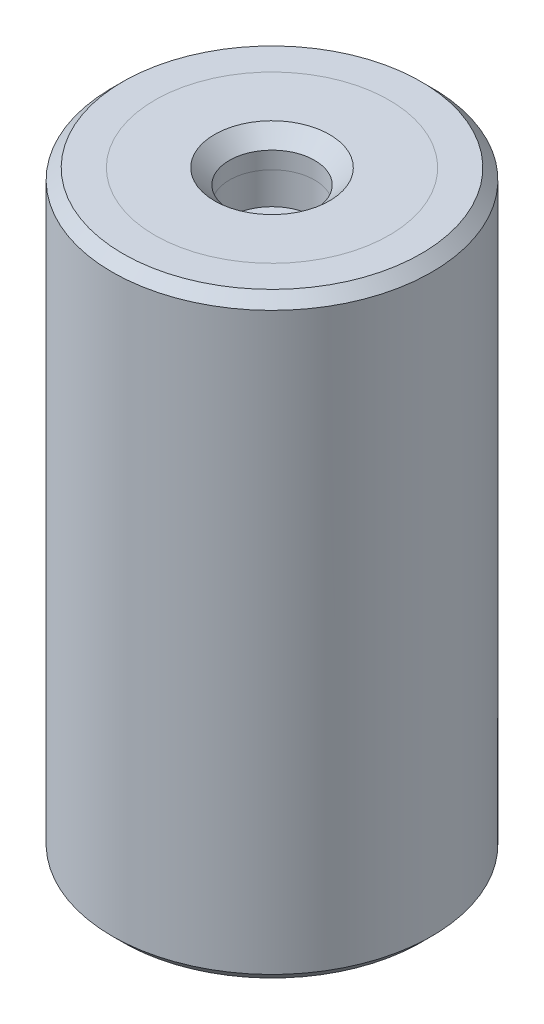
ISO-10303-21;
HEADER;
FILE_DESCRIPTION(('STEP AP214'),'2;1');
FILE_NAME('part.step','',(''),(''),'','','');
FILE_SCHEMA(('AUTOMOTIVE_DESIGN { 1 0 10303 214 1 1 1 1 }'));
ENDSEC;
DATA;
#1=APPLICATION_CONTEXT('core data for automotive mechanical design processes');
#2=APPLICATION_PROTOCOL_DEFINITION('international standard','automotive_design',2000,#1);
#3=PRODUCT_CONTEXT('',#1,'mechanical');
#4=PRODUCT('Part','Part','',(#3));
#5=PRODUCT_RELATED_PRODUCT_CATEGORY('part','',(#4));
#6=PRODUCT_DEFINITION_FORMATION('','',#4);
#7=PRODUCT_DEFINITION_CONTEXT('part definition',#1,'design');
#8=PRODUCT_DEFINITION('design','',#6,#7);
#9=PRODUCT_DEFINITION_SHAPE('','',#8);
#10=(LENGTH_UNIT() NAMED_UNIT(*) SI_UNIT(.MILLI.,.METRE.));
#11=(NAMED_UNIT(*) PLANE_ANGLE_UNIT() SI_UNIT($,.RADIAN.));
#12=(NAMED_UNIT(*) SI_UNIT($,.STERADIAN.) SOLID_ANGLE_UNIT());
#13=UNCERTAINTY_MEASURE_WITH_UNIT(LENGTH_MEASURE(1.E-05),#10,'distance_accuracy_value','');
#14=(GEOMETRIC_REPRESENTATION_CONTEXT(3) GLOBAL_UNCERTAINTY_ASSIGNED_CONTEXT((#13)) GLOBAL_UNIT_ASSIGNED_CONTEXT((#10,
#11,#12)) REPRESENTATION_CONTEXT('',''));
#15=CARTESIAN_POINT('',(0.,0.,0.));
#16=DIRECTION('',(0.,0.,1.));
#17=DIRECTION('',(1.,0.,0.));
#18=AXIS2_PLACEMENT_3D('',#15,#16,#17);
#19=CARTESIAN_POINT('',(0.,43.0340428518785,0.));
#20=DIRECTION('',(0.,1.,0.));
#21=DIRECTION('',(0.,0.,1.));
#22=AXIS2_PLACEMENT_3D('',#19,#20,#21);
#23=CYLINDRICAL_SURFACE('',#22,2.);
#24=CARTESIAN_POINT('',(0.,-25.8,0.));
#25=DIRECTION('',(0.,-1.,0.));
#26=DIRECTION('',(0.,0.,-1.));
#27=AXIS2_PLACEMENT_3D('',#24,#25,#26);
#28=CIRCLE('',#27,2.);
#29=CARTESIAN_POINT('',(0.,-25.8,-2.));
#30=VERTEX_POINT('',#29);
#31=EDGE_CURVE('P0_E10',#30,#30,#28,.T.);
#32=ORIENTED_EDGE('',*,*,#31,.T.);
#33=EDGE_LOOP('',(#32));
#34=FACE_BOUND('',#33,.T.);
#35=CARTESIAN_POINT('',(0.,-25.,0.));
#36=DIRECTION('',(0.,1.,0.));
#37=DIRECTION('',(0.,0.,1.));
#38=AXIS2_PLACEMENT_3D('',#35,#36,#37);
#39=CIRCLE('',#38,2.);
#40=CARTESIAN_POINT('',(0.,-25.,2.));
#41=VERTEX_POINT('',#40);
#42=EDGE_CURVE('P0_E25',#41,#41,#39,.T.);
#43=ORIENTED_EDGE('',*,*,#42,.T.);
#44=EDGE_LOOP('',(#43));
#45=FACE_BOUND('',#44,.T.);
#46=ADVANCED_FACE('P0_F14',(#34,#45),#23,.F.);
#47=CARTESIAN_POINT('',(0.,-25.,2.));
#48=DIRECTION('',(0.,1.,0.));
#49=DIRECTION('',(0.,0.,1.));
#50=AXIS2_PLACEMENT_3D('',#47,#48,#49);
#51=PLANE('',#50);
#52=CARTESIAN_POINT('',(0.,-25.,0.));
#53=DIRECTION('',(0.,1.,0.));
#54=DIRECTION('',(0.,0.,1.));
#55=AXIS2_PLACEMENT_3D('',#52,#53,#54);
#56=CIRCLE('',#55,5.5);
#57=CARTESIAN_POINT('',(0.,-25.,5.5));
#58=VERTEX_POINT('',#57);
#59=EDGE_CURVE('P0_E29',#58,#58,#56,.T.);
#60=ORIENTED_EDGE('',*,*,#59,.T.);
#61=EDGE_LOOP('',(#60));
#62=FACE_BOUND('',#61,.T.);
#63=ORIENTED_EDGE('',*,*,#42,.F.);
#64=EDGE_LOOP('',(#63));
#65=FACE_BOUND('',#64,.T.);
#66=ADVANCED_FACE('P0_F50',(#62,#65),#51,.T.);
#67=CARTESIAN_POINT('',(0.,43.0340428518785,0.));
#68=DIRECTION('',(0.,1.,0.));
#69=DIRECTION('',(0.,0.,1.));
#70=AXIS2_PLACEMENT_3D('',#67,#68,#69);
#71=CYLINDRICAL_SURFACE('',#70,5.5);
#72=CARTESIAN_POINT('',(0.,-26.5,0.));
#73=DIRECTION('',(0.,1.,0.));
#74=DIRECTION('',(0.,0.,1.));
#75=AXIS2_PLACEMENT_3D('',#72,#73,#74);
#76=CIRCLE('',#75,5.5);
#77=CARTESIAN_POINT('',(0.,-26.5,5.5));
#78=VERTEX_POINT('',#77);
#79=EDGE_CURVE('P0_E34',#78,#78,#76,.T.);
#80=ORIENTED_EDGE('',*,*,#79,.T.);
#81=EDGE_LOOP('',(#80));
#82=FACE_BOUND('',#81,.T.);
#83=ORIENTED_EDGE('',*,*,#59,.F.);
#84=EDGE_LOOP('',(#83));
#85=FACE_BOUND('',#84,.T.);
#86=ADVANCED_FACE('P0_F38',(#82,#85),#71,.T.);
#87=CARTESIAN_POINT('',(0.,-26.5,5.5));
#88=DIRECTION('',(0.,-1.,0.));
#89=DIRECTION('',(0.,0.,-1.));
#90=AXIS2_PLACEMENT_3D('',#87,#88,#89);
#91=PLANE('',#90);
#92=CARTESIAN_POINT('',(0.,-26.5,0.));
#93=DIRECTION('',(0.,-1.,0.));
#94=DIRECTION('',(0.,0.,-1.));
#95=AXIS2_PLACEMENT_3D('',#92,#93,#94);
#96=CIRCLE('',#95,2.7);
#97=CARTESIAN_POINT('',(0.,-26.5,-2.7));
#98=VERTEX_POINT('',#97);
#99=EDGE_CURVE('P0_E21',#98,#98,#96,.F.);
#100=ORIENTED_EDGE('',*,*,#99,.T.);
#101=EDGE_LOOP('',(#100));
#102=FACE_BOUND('',#101,.T.);
#103=ORIENTED_EDGE('',*,*,#79,.F.);
#104=EDGE_LOOP('',(#103));
#105=FACE_BOUND('',#104,.T.);
#106=ADVANCED_FACE('P0_F41',(#102,#105),#91,.T.);
#107=CARTESIAN_POINT('',(0.,-26.5,0.));
#108=DIRECTION('',(0.,-1.,0.));
#109=DIRECTION('',(0.,0.,-1.));
#110=AXIS2_PLACEMENT_3D('',#107,#108,#109);
#111=CONICAL_SURFACE('',#110,2.7,0.785398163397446);
#112=ORIENTED_EDGE('',*,*,#31,.F.);
#113=EDGE_LOOP('',(#112));
#114=FACE_BOUND('',#113,.T.);
#115=ORIENTED_EDGE('',*,*,#99,.F.);
#116=EDGE_LOOP('',(#115));
#117=FACE_BOUND('',#116,.T.);
#118=ADVANCED_FACE('P0_F16',(#114,#117),#111,.F.);
#119=CLOSED_SHELL('',(#46,#66,#86,#106,#118));
#120=MANIFOLD_SOLID_BREP('P0_B1',#119);
#121=CARTESIAN_POINT('',(0.,69.5340428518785,0.));
#122=DIRECTION('',(0.,1.,0.));
#123=DIRECTION('',(0.,0.,1.));
#124=AXIS2_PLACEMENT_3D('',#121,#122,#123);
#125=CYLINDRICAL_SURFACE('',#124,2.);
#126=CARTESIAN_POINT('',(0.,0.800000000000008,0.));
#127=DIRECTION('',(0.,1.,0.));
#128=DIRECTION('',(0.,0.,1.));
#129=AXIS2_PLACEMENT_3D('',#126,#127,#128);
#130=CIRCLE('',#129,2.);
#131=CARTESIAN_POINT('',(0.,0.800000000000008,2.));
#132=VERTEX_POINT('',#131);
#133=EDGE_CURVE('P1_E21',#132,#132,#130,.T.);
#134=ORIENTED_EDGE('',*,*,#133,.T.);
#135=EDGE_LOOP('',(#134));
#136=FACE_BOUND('',#135,.T.);
#137=CARTESIAN_POINT('',(0.,0.,0.));
#138=DIRECTION('',(0.,1.,0.));
#139=DIRECTION('',(0.,0.,1.));
#140=AXIS2_PLACEMENT_3D('',#137,#138,#139);
#141=CIRCLE('',#140,2.);
#142=CARTESIAN_POINT('',(0.,0.,2.));
#143=VERTEX_POINT('',#142);
#144=EDGE_CURVE('P1_E34',#143,#143,#141,.T.);
#145=ORIENTED_EDGE('',*,*,#144,.F.);
#146=EDGE_LOOP('',(#145));
#147=FACE_BOUND('',#146,.T.);
#148=ADVANCED_FACE('P1_F14',(#136,#147),#125,.F.);
#149=CARTESIAN_POINT('',(0.,1.5,2.));
#150=DIRECTION('',(0.,1.,0.));
#151=DIRECTION('',(0.,0.,1.));
#152=AXIS2_PLACEMENT_3D('',#149,#150,#151);
#153=PLANE('',#152);
#154=CARTESIAN_POINT('',(0.,1.5,0.));
#155=DIRECTION('',(0.,1.,0.));
#156=DIRECTION('',(0.,0.,1.));
#157=AXIS2_PLACEMENT_3D('',#154,#155,#156);
#158=CIRCLE('',#157,2.7);
#159=CARTESIAN_POINT('',(0.,1.5,2.7));
#160=VERTEX_POINT('',#159);
#161=EDGE_CURVE('P1_E10',#160,#160,#158,.F.);
#162=ORIENTED_EDGE('',*,*,#161,.T.);
#163=EDGE_LOOP('',(#162));
#164=FACE_BOUND('',#163,.T.);
#165=CARTESIAN_POINT('',(0.,1.5,0.));
#166=DIRECTION('',(0.,1.,0.));
#167=DIRECTION('',(0.,0.,1.));
#168=AXIS2_PLACEMENT_3D('',#165,#166,#167);
#169=CIRCLE('',#168,5.5);
#170=CARTESIAN_POINT('',(0.,1.5,5.5));
#171=VERTEX_POINT('',#170);
#172=EDGE_CURVE('P1_E25',#171,#171,#169,.T.);
#173=ORIENTED_EDGE('',*,*,#172,.T.);
#174=EDGE_LOOP('',(#173));
#175=FACE_BOUND('',#174,.T.);
#176=ADVANCED_FACE('P1_F42',(#164,#175),#153,.T.);
#177=CARTESIAN_POINT('',(0.,69.5340428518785,0.));
#178=DIRECTION('',(0.,1.,0.));
#179=DIRECTION('',(0.,0.,1.));
#180=AXIS2_PLACEMENT_3D('',#177,#178,#179);
#181=CYLINDRICAL_SURFACE('',#180,5.5);
#182=CARTESIAN_POINT('',(0.,0.,0.));
#183=DIRECTION('',(0.,1.,0.));
#184=DIRECTION('',(0.,0.,1.));
#185=AXIS2_PLACEMENT_3D('',#182,#183,#184);
#186=CIRCLE('',#185,5.5);
#187=CARTESIAN_POINT('',(0.,0.,5.5));
#188=VERTEX_POINT('',#187);
#189=EDGE_CURVE('P1_E29',#188,#188,#186,.T.);
#190=ORIENTED_EDGE('',*,*,#189,.T.);
#191=EDGE_LOOP('',(#190));
#192=FACE_BOUND('',#191,.T.);
#193=ORIENTED_EDGE('',*,*,#172,.F.);
#194=EDGE_LOOP('',(#193));
#195=FACE_BOUND('',#194,.T.);
#196=ADVANCED_FACE('P1_F47',(#192,#195),#181,.T.);
#197=CARTESIAN_POINT('',(0.,0.,5.5));
#198=DIRECTION('',(0.,-1.,0.));
#199=DIRECTION('',(0.,0.,-1.));
#200=AXIS2_PLACEMENT_3D('',#197,#198,#199);
#201=PLANE('',#200);
#202=ORIENTED_EDGE('',*,*,#144,.T.);
#203=EDGE_LOOP('',(#202));
#204=FACE_BOUND('',#203,.T.);
#205=ORIENTED_EDGE('',*,*,#189,.F.);
#206=EDGE_LOOP('',(#205));
#207=FACE_BOUND('',#206,.T.);
#208=ADVANCED_FACE('P1_F38',(#204,#207),#201,.T.);
#209=CARTESIAN_POINT('',(0.,0.800000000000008,0.));
#210=DIRECTION('',(0.,1.,0.));
#211=DIRECTION('',(0.,0.,1.));
#212=AXIS2_PLACEMENT_3D('',#209,#210,#211);
#213=CONICAL_SURFACE('',#212,2.,0.785398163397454);
#214=ORIENTED_EDGE('',*,*,#161,.F.);
#215=EDGE_LOOP('',(#214));
#216=FACE_BOUND('',#215,.T.);
#217=ORIENTED_EDGE('',*,*,#133,.F.);
#218=EDGE_LOOP('',(#217));
#219=FACE_BOUND('',#218,.T.);
#220=ADVANCED_FACE('P1_F16',(#216,#219),#213,.F.);
#221=CLOSED_SHELL('',(#148,#176,#196,#208,#220));
#222=MANIFOLD_SOLID_BREP('P1_B1',#221);
#223=CARTESIAN_POINT('',(0.,0.,0.));
#224=DIRECTION('',(0.,1.,0.));
#225=DIRECTION('',(0.,0.,1.));
#226=AXIS2_PLACEMENT_3D('',#223,#224,#225);
#227=PLANE('',#226);
#228=CARTESIAN_POINT('',(0.,0.,0.));
#229=DIRECTION('',(0.,1.,0.));
#230=DIRECTION('',(0.,0.,1.));
#231=AXIS2_PLACEMENT_3D('',#228,#229,#230);
#232=CIRCLE('',#231,2.);
#233=CARTESIAN_POINT('',(0.,0.,2.));
#234=VERTEX_POINT('',#233);
#235=EDGE_CURVE('P2_E46',#234,#234,#232,.T.);
#236=ORIENTED_EDGE('',*,*,#235,.F.);
#237=EDGE_LOOP('',(#236));
#238=FACE_BOUND('',#237,.T.);
#239=CARTESIAN_POINT('',(0.,0.,0.));
#240=DIRECTION('',(0.,1.,0.));
#241=DIRECTION('',(0.,0.,1.));
#242=AXIS2_PLACEMENT_3D('',#239,#240,#241);
#243=CIRCLE('',#242,5.5);
#244=CARTESIAN_POINT('',(0.,0.,5.5));
#245=VERTEX_POINT('',#244);
#246=EDGE_CURVE('P2_E33',#245,#245,#243,.T.);
#247=ORIENTED_EDGE('',*,*,#246,.T.);
#248=EDGE_LOOP('',(#247));
#249=FACE_BOUND('',#248,.T.);
#250=ADVANCED_FACE('P2_F13',(#238,#249),#227,.T.);
#251=CARTESIAN_POINT('',(0.,65.5134936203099,0.));
#252=DIRECTION('',(0.,1.,0.));
#253=DIRECTION('',(0.,0.,1.));
#254=AXIS2_PLACEMENT_3D('',#251,#252,#253);
#255=CYLINDRICAL_SURFACE('',#254,5.5);
#256=CARTESIAN_POINT('',(0.,1.5,0.));
#257=DIRECTION('',(0.,1.,0.));
#258=DIRECTION('',(0.,0.,1.));
#259=AXIS2_PLACEMENT_3D('',#256,#257,#258);
#260=CIRCLE('',#259,5.5);
#261=CARTESIAN_POINT('',(0.,1.5,5.5));
#262=VERTEX_POINT('',#261);
#263=EDGE_CURVE('P2_E36',#262,#262,#260,.T.);
#264=ORIENTED_EDGE('',*,*,#263,.T.);
#265=EDGE_LOOP('',(#264));
#266=FACE_BOUND('',#265,.T.);
#267=ORIENTED_EDGE('',*,*,#246,.F.);
#268=EDGE_LOOP('',(#267));
#269=FACE_BOUND('',#268,.T.);
#270=ADVANCED_FACE('P2_F92',(#266,#269),#255,.F.);
#271=CARTESIAN_POINT('',(0.,1.5,5.5));
#272=DIRECTION('',(0.,1.,0.));
#273=DIRECTION('',(0.,0.,1.));
#274=AXIS2_PLACEMENT_3D('',#271,#272,#273);
#275=PLANE('',#274);
#276=CARTESIAN_POINT('',(0.,1.5,0.));
#277=DIRECTION('',(0.,1.,0.));
#278=DIRECTION('',(0.,0.,1.));
#279=AXIS2_PLACEMENT_3D('',#276,#277,#278);
#280=CIRCLE('',#279,7.);
#281=CARTESIAN_POINT('',(0.,1.5,7.));
#282=VERTEX_POINT('',#281);
#283=EDGE_CURVE('P2_E9',#282,#282,#280,.T.);
#284=ORIENTED_EDGE('',*,*,#283,.T.);
#285=EDGE_LOOP('',(#284));
#286=FACE_BOUND('',#285,.T.);
#287=ORIENTED_EDGE('',*,*,#263,.F.);
#288=EDGE_LOOP('',(#287));
#289=FACE_BOUND('',#288,.T.);
#290=ADVANCED_FACE('P2_F88',(#286,#289),#275,.T.);
#291=CARTESIAN_POINT('',(0.,65.5134936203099,0.));
#292=DIRECTION('',(0.,1.,0.));
#293=DIRECTION('',(0.,0.,1.));
#294=AXIS2_PLACEMENT_3D('',#291,#292,#293);
#295=CYLINDRICAL_SURFACE('',#294,7.5);
#296=CARTESIAN_POINT('',(0.,-26.,0.));
#297=DIRECTION('',(0.,-1.,0.));
#298=DIRECTION('',(0.,0.,-1.));
#299=AXIS2_PLACEMENT_3D('',#296,#297,#298);
#300=CIRCLE('',#299,7.5);
#301=CARTESIAN_POINT('',(0.,-26.,-7.5));
#302=VERTEX_POINT('',#301);
#303=EDGE_CURVE('P2_E24',#302,#302,#300,.F.);
#304=ORIENTED_EDGE('',*,*,#303,.T.);
#305=EDGE_LOOP('',(#304));
#306=FACE_BOUND('',#305,.T.);
#307=CARTESIAN_POINT('',(0.,1.,0.));
#308=DIRECTION('',(0.,1.,0.));
#309=DIRECTION('',(0.,0.,1.));
#310=AXIS2_PLACEMENT_3D('',#307,#308,#309);
#311=CIRCLE('',#310,7.5);
#312=CARTESIAN_POINT('',(0.,1.,7.5));
#313=VERTEX_POINT('',#312);
#314=EDGE_CURVE('P2_E28',#313,#313,#311,.F.);
#315=ORIENTED_EDGE('',*,*,#314,.T.);
#316=EDGE_LOOP('',(#315));
#317=FACE_BOUND('',#316,.T.);
#318=ADVANCED_FACE('P2_F82',(#306,#317),#295,.T.);
#319=CARTESIAN_POINT('',(0.,-26.5,7.5));
#320=DIRECTION('',(0.,-1.,0.));
#321=DIRECTION('',(0.,0.,-1.));
#322=AXIS2_PLACEMENT_3D('',#319,#320,#321);
#323=PLANE('',#322);
#324=CARTESIAN_POINT('',(0.,-26.5,0.));
#325=DIRECTION('',(0.,-1.,0.));
#326=DIRECTION('',(0.,0.,-1.));
#327=AXIS2_PLACEMENT_3D('',#324,#325,#326);
#328=CIRCLE('',#327,6.99999999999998);
#329=CARTESIAN_POINT('',(0.,-26.5,-6.99999999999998));
#330=VERTEX_POINT('',#329);
#331=EDGE_CURVE('P2_E20',#330,#330,#328,.T.);
#332=ORIENTED_EDGE('',*,*,#331,.T.);
#333=EDGE_LOOP('',(#332));
#334=FACE_BOUND('',#333,.T.);
#335=CARTESIAN_POINT('',(0.,-26.5,0.));
#336=DIRECTION('',(0.,1.,0.));
#337=DIRECTION('',(0.,0.,1.));
#338=AXIS2_PLACEMENT_3D('',#335,#336,#337);
#339=CIRCLE('',#338,5.49999999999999);
#340=CARTESIAN_POINT('',(0.,-26.5,5.49999999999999));
#341=VERTEX_POINT('',#340);
#342=EDGE_CURVE('P2_E39',#341,#341,#339,.T.);
#343=ORIENTED_EDGE('',*,*,#342,.T.);
#344=EDGE_LOOP('',(#343));
#345=FACE_BOUND('',#344,.T.);
#346=ADVANCED_FACE('P2_F77',(#334,#345),#323,.T.);
#347=CARTESIAN_POINT('',(0.,65.5134936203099,0.));
#348=DIRECTION('',(0.,1.,0.));
#349=DIRECTION('',(0.,0.,1.));
#350=AXIS2_PLACEMENT_3D('',#347,#348,#349);
#351=CYLINDRICAL_SURFACE('',#350,5.49999999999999);
#352=CARTESIAN_POINT('',(0.,-25.,0.));
#353=DIRECTION('',(0.,1.,0.));
#354=DIRECTION('',(0.,0.,1.));
#355=AXIS2_PLACEMENT_3D('',#352,#353,#354);
#356=CIRCLE('',#355,5.49999999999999);
#357=CARTESIAN_POINT('',(0.,-25.,5.49999999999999));
#358=VERTEX_POINT('',#357);
#359=EDGE_CURVE('P2_E42',#358,#358,#356,.T.);
#360=ORIENTED_EDGE('',*,*,#359,.T.);
#361=EDGE_LOOP('',(#360));
#362=FACE_BOUND('',#361,.T.);
#363=ORIENTED_EDGE('',*,*,#342,.F.);
#364=EDGE_LOOP('',(#363));
#365=FACE_BOUND('',#364,.T.);
#366=ADVANCED_FACE('P2_F71',(#362,#365),#351,.F.);
#367=CARTESIAN_POINT('',(0.,-25.,5.49999999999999));
#368=DIRECTION('',(0.,-1.,0.));
#369=DIRECTION('',(0.,0.,-1.));
#370=AXIS2_PLACEMENT_3D('',#367,#368,#369);
#371=PLANE('',#370);
#372=CARTESIAN_POINT('',(0.,-25.,0.));
#373=DIRECTION('',(0.,-1.,0.));
#374=DIRECTION('',(0.,0.,-1.));
#375=AXIS2_PLACEMENT_3D('',#372,#373,#374);
#376=CIRCLE('',#375,2.);
#377=CARTESIAN_POINT('',(0.,-25.,-2.));
#378=VERTEX_POINT('',#377);
#379=EDGE_CURVE('P2_E52',#378,#378,#376,.T.);
#380=ORIENTED_EDGE('',*,*,#379,.F.);
#381=EDGE_LOOP('',(#380));
#382=FACE_BOUND('',#381,.T.);
#383=ORIENTED_EDGE('',*,*,#359,.F.);
#384=EDGE_LOOP('',(#383));
#385=FACE_BOUND('',#384,.T.);
#386=ADVANCED_FACE('P2_F67',(#382,#385),#371,.T.);
#387=CARTESIAN_POINT('',(0.,-26.,0.));
#388=DIRECTION('',(0.,1.,0.));
#389=DIRECTION('',(0.,0.,1.));
#390=AXIS2_PLACEMENT_3D('',#387,#388,#389);
#391=CONICAL_SURFACE('',#390,7.5,0.78539816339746);
#392=ORIENTED_EDGE('',*,*,#331,.F.);
#393=EDGE_LOOP('',(#392));
#394=FACE_BOUND('',#393,.T.);
#395=ORIENTED_EDGE('',*,*,#303,.F.);
#396=EDGE_LOOP('',(#395));
#397=FACE_BOUND('',#396,.T.);
#398=ADVANCED_FACE('P2_F70',(#394,#397),#391,.T.);
#399=CARTESIAN_POINT('',(0.,1.5,0.));
#400=DIRECTION('',(0.,-1.,0.));
#401=DIRECTION('',(0.,0.,-1.));
#402=AXIS2_PLACEMENT_3D('',#399,#400,#401);
#403=CONICAL_SURFACE('',#402,7.,0.78539816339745);
#404=ORIENTED_EDGE('',*,*,#314,.F.);
#405=EDGE_LOOP('',(#404));
#406=FACE_BOUND('',#405,.T.);
#407=ORIENTED_EDGE('',*,*,#283,.F.);
#408=EDGE_LOOP('',(#407));
#409=FACE_BOUND('',#408,.T.);
#410=ADVANCED_FACE('P2_F15',(#406,#409),#403,.T.);
#411=CARTESIAN_POINT('',(0.,-1.5,0.));
#412=DIRECTION('',(0.,1.,0.));
#413=DIRECTION('',(0.,0.,1.));
#414=AXIS2_PLACEMENT_3D('',#411,#412,#413);
#415=CYLINDRICAL_SURFACE('',#414,2.);
#416=CARTESIAN_POINT('',(0.,-1.5,0.));
#417=DIRECTION('',(0.,1.,0.));
#418=DIRECTION('',(0.,0.,1.));
#419=AXIS2_PLACEMENT_3D('',#416,#417,#418);
#420=CIRCLE('',#419,2.);
#421=CARTESIAN_POINT('',(0.,-1.5,2.));
#422=VERTEX_POINT('',#421);
#423=EDGE_CURVE('P2_E45',#422,#422,#420,.T.);
#424=ORIENTED_EDGE('',*,*,#423,.F.);
#425=EDGE_LOOP('',(#424));
#426=FACE_BOUND('',#425,.T.);
#427=ORIENTED_EDGE('',*,*,#235,.T.);
#428=EDGE_LOOP('',(#427));
#429=FACE_BOUND('',#428,.T.);
#430=ADVANCED_FACE('P2_F108',(#426,#429),#415,.F.);
#431=CARTESIAN_POINT('',(0.,-1.5,0.));
#432=DIRECTION('',(0.,1.,0.));
#433=DIRECTION('',(0.,0.,1.));
#434=AXIS2_PLACEMENT_3D('',#431,#432,#433);
#435=PLANE('',#434);
#436=ORIENTED_EDGE('',*,*,#423,.T.);
#437=EDGE_LOOP('',(#436));
#438=FACE_BOUND('',#437,.T.);
#439=ADVANCED_FACE('P2_F63',(#438),#435,.T.);
#440=CARTESIAN_POINT('',(0.,-23.5,0.));
#441=DIRECTION('',(0.,-1.,0.));
#442=DIRECTION('',(0.,0.,-1.));
#443=AXIS2_PLACEMENT_3D('',#440,#441,#442);
#444=CYLINDRICAL_SURFACE('',#443,2.);
#445=CARTESIAN_POINT('',(0.,-23.5,0.));
#446=DIRECTION('',(0.,-1.,0.));
#447=DIRECTION('',(0.,0.,-1.));
#448=AXIS2_PLACEMENT_3D('',#445,#446,#447);
#449=CIRCLE('',#448,2.);
#450=CARTESIAN_POINT('',(0.,-23.5,-2.));
#451=VERTEX_POINT('',#450);
#452=EDGE_CURVE('P2_E49',#451,#451,#449,.T.);
#453=ORIENTED_EDGE('',*,*,#452,.F.);
#454=EDGE_LOOP('',(#453));
#455=FACE_BOUND('',#454,.T.);
#456=ORIENTED_EDGE('',*,*,#379,.T.);
#457=EDGE_LOOP('',(#456));
#458=FACE_BOUND('',#457,.T.);
#459=ADVANCED_FACE('P2_F60',(#455,#458),#444,.F.);
#460=CARTESIAN_POINT('',(0.,-23.5,0.));
#461=DIRECTION('',(0.,-1.,0.));
#462=DIRECTION('',(0.,0.,-1.));
#463=AXIS2_PLACEMENT_3D('',#460,#461,#462);
#464=PLANE('',#463);
#465=ORIENTED_EDGE('',*,*,#452,.T.);
#466=EDGE_LOOP('',(#465));
#467=FACE_BOUND('',#466,.T.);
#468=ADVANCED_FACE('P2_F58',(#467),#464,.T.);
#469=CLOSED_SHELL('',(#250,#270,#290,#318,#346,#366,#386,#398,#410,#430,#439,#459,#468));
#470=MANIFOLD_SOLID_BREP('P2_B1',#469);
#471=ADVANCED_BREP_SHAPE_REPRESENTATION('',(#18,#120,#222,#470),#14);
#472=SHAPE_DEFINITION_REPRESENTATION(#9,#471);
ENDSEC;
END-ISO-10303-21;
